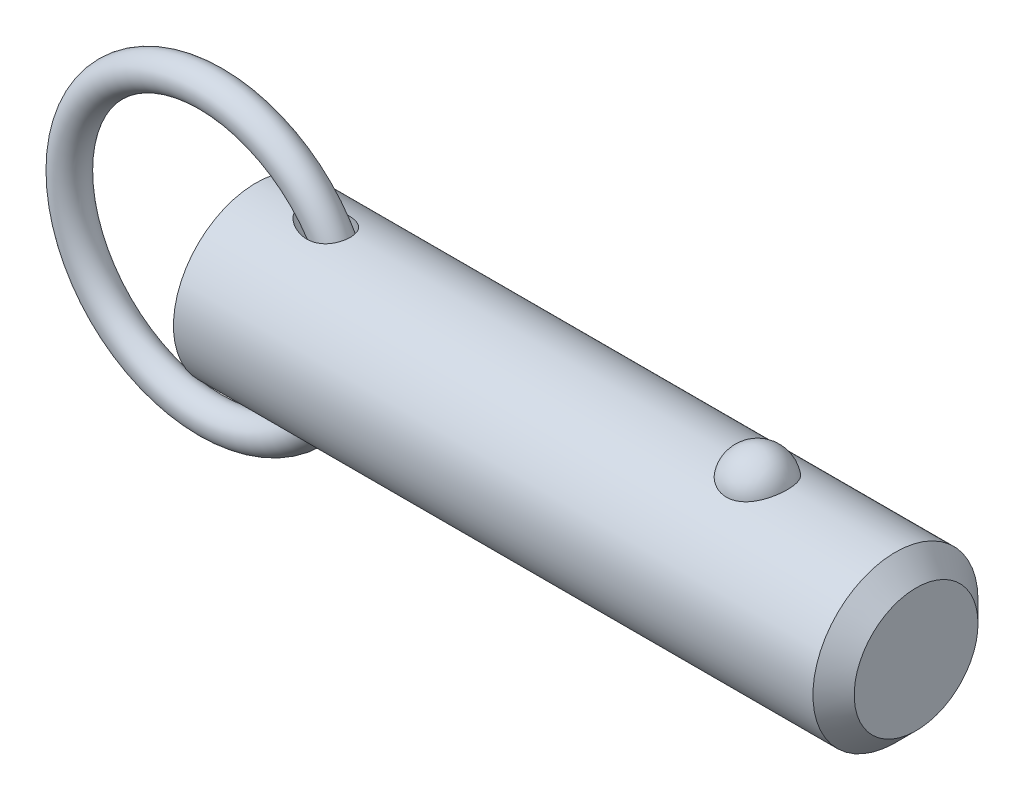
ISO-10303-21;
HEADER;
FILE_DESCRIPTION(('STEP AP214'),'2;1');
FILE_NAME('part.step','',(''),(''),'','','');
FILE_SCHEMA(('AUTOMOTIVE_DESIGN { 1 0 10303 214 1 1 1 1 }'));
ENDSEC;
DATA;
#1=APPLICATION_CONTEXT('core data for automotive mechanical design processes');
#2=APPLICATION_PROTOCOL_DEFINITION('international standard','automotive_design',2000,#1);
#3=PRODUCT_CONTEXT('',#1,'mechanical');
#4=PRODUCT('Part','Part','',(#3));
#5=PRODUCT_RELATED_PRODUCT_CATEGORY('part','',(#4));
#6=PRODUCT_DEFINITION_FORMATION('','',#4);
#7=PRODUCT_DEFINITION_CONTEXT('part definition',#1,'design');
#8=PRODUCT_DEFINITION('design','',#6,#7);
#9=PRODUCT_DEFINITION_SHAPE('','',#8);
#10=(LENGTH_UNIT() NAMED_UNIT(*) SI_UNIT(.MILLI.,.METRE.));
#11=(NAMED_UNIT(*) PLANE_ANGLE_UNIT() SI_UNIT($,.RADIAN.));
#12=(NAMED_UNIT(*) SI_UNIT($,.STERADIAN.) SOLID_ANGLE_UNIT());
#13=UNCERTAINTY_MEASURE_WITH_UNIT(LENGTH_MEASURE(1.E-05),#10,'distance_accuracy_value','');
#14=(GEOMETRIC_REPRESENTATION_CONTEXT(3) GLOBAL_UNCERTAINTY_ASSIGNED_CONTEXT((#13)) GLOBAL_UNIT_ASSIGNED_CONTEXT((#10,
#11,#12)) REPRESENTATION_CONTEXT('',''));
#15=CARTESIAN_POINT('',(0.,0.,0.));
#16=DIRECTION('',(0.,0.,1.));
#17=DIRECTION('',(1.,0.,0.));
#18=AXIS2_PLACEMENT_3D('',#15,#16,#17);
#19=CARTESIAN_POINT('',(-6.08699288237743,0.,0.));
#20=DIRECTION('',(0.,0.,1.));
#21=DIRECTION('',(1.,0.,0.));
#22=AXIS2_PLACEMENT_3D('',#19,#20,#21);
#23=TOROIDAL_SURFACE('',#22,19.05,2.223);
#24=CARTESIAN_POINT('',(15.1860071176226,0.,0.));
#25=VERTEX_POINT('',#24);
#26=VERTEX_LOOP('',#25);
#27=FACE_BOUND('',#26,.T.);
#28=ADVANCED_FACE('P0_F12',(#27),#23,.T.);
#29=CLOSED_SHELL('',(#28));
#30=MANIFOLD_SOLID_BREP('P0_B1',#29);
#31=CARTESIAN_POINT('',(0.,0.,0.));
#32=DIRECTION('',(1.,0.,0.));
#33=DIRECTION('',(0.,0.,-1.));
#34=AXIS2_PLACEMENT_3D('',#31,#32,#33);
#35=CYLINDRICAL_SURFACE('',#34,11.115);
#36=CARTESIAN_POINT('',(6.41405181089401,11.0227946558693,-1.4287136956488));
#37=CARTESIAN_POINT('',(6.49338916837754,11.0115377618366,-1.51556642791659));
#38=CARTESIAN_POINT('',(6.57765461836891,10.9998263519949,-1.59789397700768));
#39=CARTESIAN_POINT('',(6.75386647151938,10.9760304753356,-1.75391400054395));
#40=CARTESIAN_POINT('',(6.84582247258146,10.9639455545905,-1.82759540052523));
#41=CARTESIAN_POINT('',(7.03627827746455,10.9397989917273,-1.96698954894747));
#42=CARTESIAN_POINT('',(7.13480838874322,10.9277377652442,-2.03266078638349));
#43=CARTESIAN_POINT('',(7.33681032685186,10.9041015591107,-2.1558582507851));
#44=CARTESIAN_POINT('',(7.44028007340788,10.8925263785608,-2.21338786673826));
#45=CARTESIAN_POINT('',(7.64386117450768,10.8710104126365,-2.31666528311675));
#46=CARTESIAN_POINT('',(7.74368989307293,10.8610119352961,-2.36295942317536));
#47=CARTESIAN_POINT('',(7.94637195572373,10.8420168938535,-2.44863486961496));
#48=CARTESIAN_POINT('',(8.04922612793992,10.8330206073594,-2.48801426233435));
#49=CARTESIAN_POINT('',(8.36115573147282,10.807980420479,-2.59542730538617));
#50=CARTESIAN_POINT('',(8.57411849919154,10.7938278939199,-2.65299817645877));
#51=CARTESIAN_POINT('',(9.00825016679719,10.7725818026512,-2.73800108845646));
#52=CARTESIAN_POINT('',(9.22947335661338,10.7655491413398,-2.76517330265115));
#53=CARTESIAN_POINT('',(9.67368141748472,10.7605872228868,-2.78445308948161));
#54=CARTESIAN_POINT('',(9.89666486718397,10.7626512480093,-2.77658653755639));
#55=CARTESIAN_POINT('',(10.2950172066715,10.7754452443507,-2.72644436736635));
#56=CARTESIAN_POINT('',(10.4712789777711,10.7844280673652,-2.69109376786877));
#57=CARTESIAN_POINT('',(10.7292776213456,10.8024982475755,-2.61722365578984));
#58=CARTESIAN_POINT('',(10.8142337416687,10.8092901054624,-2.58911576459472));
#59=CARTESIAN_POINT('',(10.9813218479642,10.8242580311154,-2.52581287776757));
#60=CARTESIAN_POINT('',(11.0634550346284,10.8324335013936,-2.49062094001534));
#61=CARTESIAN_POINT('',(11.2247418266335,10.8500287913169,-2.41281958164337));
#62=CARTESIAN_POINT('',(11.3038694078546,10.8594572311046,-2.37015806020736));
#63=CARTESIAN_POINT('',(11.4576781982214,10.8792243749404,-2.27770403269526));
#64=CARTESIAN_POINT('',(11.5323615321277,10.8895626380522,-2.22791497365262));
#65=CARTESIAN_POINT('',(11.6765388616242,10.9108113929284,-2.12140590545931));
#66=CARTESIAN_POINT('',(11.7460329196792,10.9217218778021,-2.064685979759));
#67=CARTESIAN_POINT('',(11.8790597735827,10.9437207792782,-1.94471764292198));
#68=CARTESIAN_POINT('',(11.9425932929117,10.9548091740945,-1.88147002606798));
#69=CARTESIAN_POINT('',(12.109388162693,10.9851999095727,-1.69784918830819));
#70=CARTESIAN_POINT('',(12.205655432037,11.0042655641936,-1.57093023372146));
#71=CARTESIAN_POINT('',(12.374151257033,11.0393391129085,-1.3017676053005));
#72=CARTESIAN_POINT('',(12.4463875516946,11.0553479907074,-1.15952888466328));
#73=CARTESIAN_POINT('',(12.5615818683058,11.0816338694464,-0.871972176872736));
#74=CARTESIAN_POINT('',(12.6058896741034,11.0921698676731,-0.727217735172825));
#75=CARTESIAN_POINT('',(12.6699315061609,11.1075802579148,-0.432089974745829));
#76=CARTESIAN_POINT('',(12.6896681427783,11.1124552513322,-0.281717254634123));
#77=CARTESIAN_POINT('',(12.7040225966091,11.1159901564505,0.0188164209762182));
#78=CARTESIAN_POINT('',(12.6988836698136,11.1147102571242,0.16896512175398));
#79=CARTESIAN_POINT('',(12.6641681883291,11.1062126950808,0.46623811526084));
#80=CARTESIAN_POINT('',(12.6345920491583,11.0989951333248,0.613362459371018));
#81=CARTESIAN_POINT('',(12.5517453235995,11.0794095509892,0.900330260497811));
#82=CARTESIAN_POINT('',(12.4984878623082,11.0670443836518,1.04017770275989));
#83=CARTESIAN_POINT('',(12.3696588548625,11.0385082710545,1.308745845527));
#84=CARTESIAN_POINT('',(12.2940887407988,11.0223375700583,1.43746725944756));
#85=CARTESIAN_POINT('',(12.122380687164,10.987872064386,1.68079704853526));
#86=CARTESIAN_POINT('',(12.0261637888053,10.969569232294,1.79534850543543));
#87=CARTESIAN_POINT('',(11.8161707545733,10.932836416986,2.00695695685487));
#88=CARTESIAN_POINT('',(11.7023941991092,10.9144064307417,2.10401353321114));
#89=CARTESIAN_POINT('',(11.4575656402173,10.8788057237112,2.28105326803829));
#90=CARTESIAN_POINT('',(11.3261451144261,10.8616794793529,2.36053412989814));
#91=CARTESIAN_POINT('',(11.0523589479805,10.8308019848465,2.49839044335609));
#92=CARTESIAN_POINT('',(10.9099908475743,10.8170514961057,2.55676113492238));
#93=CARTESIAN_POINT('',(10.6060622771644,10.7929728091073,2.65666105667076));
#94=CARTESIAN_POINT('',(10.4438877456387,10.7830209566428,2.69640163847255));
#95=CARTESIAN_POINT('',(10.1154037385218,10.7687230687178,2.75293129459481));
#96=CARTESIAN_POINT('',(9.94909141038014,10.7643810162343,2.76970406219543));
#97=CARTESIAN_POINT('',(9.54387061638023,10.7604809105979,2.7848723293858));
#98=CARTESIAN_POINT('',(9.30446860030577,10.7637793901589,2.7722775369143));
#99=CARTESIAN_POINT('',(8.9496125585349,10.7757341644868,2.72524141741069));
#100=CARTESIAN_POINT('',(8.83186896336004,10.7808994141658,2.70482239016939));
#101=CARTESIAN_POINT('',(8.59835142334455,10.7932548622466,2.6550999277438));
#102=CARTESIAN_POINT('',(8.48257728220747,10.8004448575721,2.62579738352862));
#103=CARTESIAN_POINT('',(8.25208469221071,10.8166382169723,2.55827624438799));
#104=CARTESIAN_POINT('',(8.13740214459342,10.8256649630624,2.51994155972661));
#105=CARTESIAN_POINT('',(7.91132058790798,10.8451170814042,2.43486475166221));
#106=CARTESIAN_POINT('',(7.79992154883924,10.8555424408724,2.38812270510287));
#107=CARTESIAN_POINT('',(7.58115677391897,10.8774251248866,2.28638483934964));
#108=CARTESIAN_POINT('',(7.47378802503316,10.8888816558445,2.23139534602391));
#109=CARTESIAN_POINT('',(7.26385624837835,10.9124540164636,2.1131026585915));
#110=CARTESIAN_POINT('',(7.1612916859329,10.9245696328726,2.04980214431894));
#111=CARTESIAN_POINT('',(6.91882218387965,10.9543689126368,1.88540538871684));
#112=CARTESIAN_POINT('',(6.78193778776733,10.9721958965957,1.77979827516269));
#113=CARTESIAN_POINT('',(6.5247244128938,11.0070222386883,1.54989693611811));
#114=CARTESIAN_POINT('',(6.40436902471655,11.0240228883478,1.42563320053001));
#115=CARTESIAN_POINT('',(6.21838804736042,11.0509658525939,1.19529359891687));
#116=CARTESIAN_POINT('',(6.14691885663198,11.0615430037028,1.09404520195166));
#117=CARTESIAN_POINT('',(6.02043496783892,11.0805004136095,0.881508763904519));
#118=CARTESIAN_POINT('',(5.96539400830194,11.0888841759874,0.770237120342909));
#119=CARTESIAN_POINT('',(5.88475453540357,11.1012553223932,0.560577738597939));
#120=CARTESIAN_POINT('',(5.85559643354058,11.1057686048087,0.463603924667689));
#121=CARTESIAN_POINT('',(5.81381299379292,11.1122523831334,0.266083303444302));
#122=CARTESIAN_POINT('',(5.80117118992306,11.1142254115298,0.16554015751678));
#123=CARTESIAN_POINT('',(5.79363815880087,11.1153999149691,-0.0364747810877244));
#124=CARTESIAN_POINT('',(5.79878799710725,11.1145949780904,-0.137948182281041));
#125=CARTESIAN_POINT('',(5.82639592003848,11.1102987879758,-0.338493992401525));
#126=CARTESIAN_POINT('',(5.84887234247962,11.1068046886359,-0.437563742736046));
#127=CARTESIAN_POINT('',(5.91510741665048,11.0965857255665,-0.649968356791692));
#128=CARTESIAN_POINT('',(5.9622090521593,11.0893566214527,-0.762222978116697));
#129=CARTESIAN_POINT('',(6.07378449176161,11.072471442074,-0.97739679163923));
#130=CARTESIAN_POINT('',(6.13826787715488,11.0628140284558,-1.08031079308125));
#131=CARTESIAN_POINT('',(6.2410107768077,11.0477136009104,-1.22195806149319));
#132=CARTESIAN_POINT('',(6.27403486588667,11.042895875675,-1.26469183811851));
#133=CARTESIAN_POINT('',(6.34238022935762,11.0330152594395,-1.34817011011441));
#134=CARTESIAN_POINT('',(6.37769867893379,11.0279526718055,-1.38891694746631));
#135=CARTESIAN_POINT('',(6.41405181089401,11.0227946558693,-1.4287136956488));
#136=B_SPLINE_CURVE_WITH_KNOTS('',3,(#36,#37,#38,#39,#40,#41,#42,#43,#44,#45,#46,#47,#48,#49,
#50,#51,#52,#53,#54,#55,#56,#57,#58,#59,#60,#61,#62,#63,#64,#65,#66,#67,#68,#69,#70,#71,#72,#73,
#74,#75,#76,#77,#78,#79,#80,#81,#82,#83,#84,#85,#86,#87,#88,#89,#90,#91,#92,#93,#94,#95,#96,#97,
#98,#99,#100,#101,#102,#103,#104,#105,#106,#107,#108,#109,#110,#111,#112,#113,#114,#115,#116,
#117,#118,#119,#120,#121,#122,#123,#124,#125,#126,#127,#128,#129,#130,#131,#132,#133,#134,#135),
.UNSPECIFIED.,.T.,.F.,(4,2,2,2,2,2,2,2,2,2,2,2,2,2,2,2,2,2,2,2,2,2,2,2,2,2,2,2,2,2,2,2,2,2,2,2,
2,2,2,2,2,2,2,2,2,2,2,2,2,4),(0.,0.35443329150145,0.709315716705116,1.0659654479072,
1.42246628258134,1.7536715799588,2.08496839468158,2.74582009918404,3.41227815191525,
4.07824412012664,4.61583787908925,4.88478112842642,5.1536085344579,5.42439170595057,
5.69504436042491,5.96569375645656,6.23631025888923,6.71490729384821,7.1933500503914,
7.64641437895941,8.09943057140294,8.54802575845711,8.99661331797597,9.44495256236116,
9.89326303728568,10.3433195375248,10.7933867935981,11.2550086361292,11.7167345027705,
12.2165866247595,12.7167934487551,13.4318876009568,13.7904664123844,14.1490092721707,
14.5124394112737,14.8758662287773,15.239015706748,15.6020483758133,16.1219860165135,
16.6410830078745,17.0130520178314,17.3844231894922,17.6872330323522,17.9897407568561,
18.2929471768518,18.5964749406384,18.9603532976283,19.3244326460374,19.4870338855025,
19.649438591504),.UNSPECIFIED.);
#137=CARTESIAN_POINT('',(6.41405181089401,11.0227946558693,-1.4287136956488));
#138=VERTEX_POINT('',#137);
#139=EDGE_CURVE('P1_E40',#138,#138,#136,.T.);
#140=ORIENTED_EDGE('',*,*,#139,.T.);
#141=EDGE_LOOP('',(#140));
#142=FACE_BOUND('',#141,.T.);
#143=CARTESIAN_POINT('',(86.12125,0.,0.));
#144=DIRECTION('',(1.,0.,0.));
#145=DIRECTION('',(0.,0.,-1.));
#146=AXIS2_PLACEMENT_3D('',#143,#144,#145);
#147=CIRCLE('',#146,11.115);
#148=CARTESIAN_POINT('',(86.12125,0.,-11.115));
#149=VERTEX_POINT('',#148);
#150=EDGE_CURVE('P1_E25',#149,#149,#147,.T.);
#151=ORIENTED_EDGE('',*,*,#150,.F.);
#152=EDGE_LOOP('',(#151));
#153=FACE_BOUND('',#152,.T.);
#154=CARTESIAN_POINT('',(0.,0.,0.));
#155=DIRECTION('',(1.,0.,0.));
#156=DIRECTION('',(0.,0.,-1.));
#157=AXIS2_PLACEMENT_3D('',#154,#155,#156);
#158=CIRCLE('',#157,11.115);
#159=CARTESIAN_POINT('',(0.,0.,-11.115));
#160=VERTEX_POINT('',#159);
#161=EDGE_CURVE('P1_E9',#160,#160,#158,.T.);
#162=ORIENTED_EDGE('',*,*,#161,.T.);
#163=EDGE_LOOP('',(#162));
#164=FACE_BOUND('',#163,.T.);
#165=CARTESIAN_POINT('',(67.5310680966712,10.3028087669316,4.17077409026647));
#166=CARTESIAN_POINT('',(67.3147756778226,10.3028003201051,4.17078240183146));
#167=CARTESIAN_POINT('',(67.0985488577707,10.3098895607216,4.15340593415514));
#168=CARTESIAN_POINT('',(66.6725408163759,10.3373834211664,4.08449540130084));
#169=CARTESIAN_POINT('',(66.4627577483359,10.3577841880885,4.03297121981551));
#170=CARTESIAN_POINT('',(66.0557825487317,10.4095237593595,3.89746513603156));
#171=CARTESIAN_POINT('',(65.8585726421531,10.4408466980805,3.81353029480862));
#172=CARTESIAN_POINT('',(65.4813382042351,10.5110236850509,3.61560339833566));
#173=CARTESIAN_POINT('',(65.3013171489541,10.5498792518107,3.50160528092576));
#174=CARTESIAN_POINT('',(64.9576842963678,10.6322884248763,3.24292464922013));
#175=CARTESIAN_POINT('',(64.7946861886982,10.6759443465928,3.09746040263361));
#176=CARTESIAN_POINT('',(64.4945911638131,10.7625291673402,2.78171925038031));
#177=CARTESIAN_POINT('',(64.3574990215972,10.8054579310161,2.61143778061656));
#178=CARTESIAN_POINT('',(64.1064084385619,10.8881935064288,2.24226695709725));
#179=CARTESIAN_POINT('',(63.9937105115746,10.9277761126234,2.04244123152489));
#180=CARTESIAN_POINT('',(63.8017771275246,10.997484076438,1.62578254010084));
#181=CARTESIAN_POINT('',(63.722544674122,11.0276085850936,1.40894804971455));
#182=CARTESIAN_POINT('',(63.5983034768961,11.0756732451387,0.961250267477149));
#183=CARTESIAN_POINT('',(63.553760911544,11.0934470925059,0.730239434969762));
#184=CARTESIAN_POINT('',(63.5015695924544,11.1143331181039,0.263439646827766));
#185=CARTESIAN_POINT('',(63.4939200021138,11.1174456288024,0.0276507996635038));
#186=CARTESIAN_POINT('',(63.5156105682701,11.1087161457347,-0.440729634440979));
#187=CARTESIAN_POINT('',(63.5447624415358,11.0969502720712,-0.673331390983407));
#188=CARTESIAN_POINT('',(63.6391432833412,11.0597872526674,-1.12996621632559));
#189=CARTESIAN_POINT('',(63.7043729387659,11.0343898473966,-1.35399912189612));
#190=CARTESIAN_POINT('',(63.8696984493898,10.972515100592,-1.78750286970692));
#191=CARTESIAN_POINT('',(63.9698386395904,10.9360236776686,-1.99695478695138));
#192=CARTESIAN_POINT('',(64.2029408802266,10.8557595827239,-2.39520667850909));
#193=CARTESIAN_POINT('',(64.3359054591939,10.8119863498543,-2.5840050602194));
#194=CARTESIAN_POINT('',(64.632407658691,10.7216733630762,-2.93635726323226));
#195=CARTESIAN_POINT('',(64.7960565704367,10.675123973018,-3.09981510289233));
#196=CARTESIAN_POINT('',(65.1498601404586,10.5846571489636,-3.39592247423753));
#197=CARTESIAN_POINT('',(65.3400123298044,10.5407394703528,-3.52857487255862));
#198=CARTESIAN_POINT('',(65.7375014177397,10.4616690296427,-3.75646057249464));
#199=CARTESIAN_POINT('',(65.9443670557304,10.4263443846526,-3.85245432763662));
#200=CARTESIAN_POINT('',(66.3729541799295,10.3675574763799,-4.0079874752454));
#201=CARTESIAN_POINT('',(66.594670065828,10.3440907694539,-4.06754052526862));
#202=CARTESIAN_POINT('',(67.0346695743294,10.3128282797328,-4.14614314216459));
#203=CARTESIAN_POINT('',(67.2525654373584,10.3043040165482,-4.16707833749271));
#204=CARTESIAN_POINT('',(67.68894951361,10.3016771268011,-4.17357158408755));
#205=CARTESIAN_POINT('',(67.9074376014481,10.3075716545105,-4.15913661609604));
#206=CARTESIAN_POINT('',(68.3317442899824,10.3326686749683,-4.09636961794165));
#207=CARTESIAN_POINT('',(68.5377458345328,10.3514555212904,-4.04909574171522));
#208=CARTESIAN_POINT('',(68.9385764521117,10.3998183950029,-3.92320197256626));
#209=CARTESIAN_POINT('',(69.1334046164,10.4293952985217,-3.84457953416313));
#210=CARTESIAN_POINT('',(69.5111917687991,10.4969600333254,-3.65612410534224));
#211=CARTESIAN_POINT('',(69.6937974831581,10.5351178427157,-3.5456454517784));
#212=CARTESIAN_POINT('',(70.0382040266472,10.6154999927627,-3.29718036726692));
#213=CARTESIAN_POINT('',(70.200000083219,10.657725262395,-3.15918764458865));
#214=CARTESIAN_POINT('',(70.5069596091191,10.744212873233,-2.85163580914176));
#215=CARTESIAN_POINT('',(70.6508919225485,10.7884718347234,-2.68084605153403));
#216=CARTESIAN_POINT('',(70.9092371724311,10.872374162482,-2.31721864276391));
#217=CARTESIAN_POINT('',(71.0236448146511,10.9120167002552,-2.12437704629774));
#218=CARTESIAN_POINT('',(71.2238739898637,10.9838919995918,-1.71516999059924));
#219=CARTESIAN_POINT('',(71.3086617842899,11.0158465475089,-1.49824866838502));
#220=CARTESIAN_POINT('',(71.4426838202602,11.0673523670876,-1.05228572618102));
#221=CARTESIAN_POINT('',(71.4919174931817,11.086903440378,-0.823243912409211));
#222=CARTESIAN_POINT('',(71.5538915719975,11.1116323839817,-0.359087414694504));
#223=CARTESIAN_POINT('',(71.5665662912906,11.1167843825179,-0.123962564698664));
#224=CARTESIAN_POINT('',(71.554973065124,11.1121144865,0.345220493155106));
#225=CARTESIAN_POINT('',(71.5307056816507,11.1022928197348,0.579278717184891));
#226=CARTESIAN_POINT('',(71.4459073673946,11.0687504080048,1.03866534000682));
#227=CARTESIAN_POINT('',(71.3855299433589,11.0450885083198,1.26402641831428));
#228=CARTESIAN_POINT('',(71.2298532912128,10.9863185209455,1.70076772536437));
#229=CARTESIAN_POINT('',(71.134551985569,10.9512097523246,1.91214712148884));
#230=CARTESIAN_POINT('',(70.9103974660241,10.8729733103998,2.316083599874));
#231=CARTESIAN_POINT('',(70.7813806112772,10.8298068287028,2.50854240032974));
#232=CARTESIAN_POINT('',(70.4927327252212,10.7401896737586,2.86808766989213));
#233=CARTESIAN_POINT('',(70.3331022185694,10.6937390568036,3.03517457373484));
#234=CARTESIAN_POINT('',(69.9875341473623,10.6029321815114,3.33857581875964));
#235=CARTESIAN_POINT('',(69.8017089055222,10.5585680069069,3.47501541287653));
#236=CARTESIAN_POINT('',(69.4078750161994,10.4769321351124,3.71390897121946));
#237=CARTESIAN_POINT('',(69.1998635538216,10.439661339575,3.81635861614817));
#238=CARTESIAN_POINT('',(68.7540666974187,10.3749407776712,3.98910631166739));
#239=CARTESIAN_POINT('',(68.5152342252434,10.3482457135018,4.05700929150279));
#240=CARTESIAN_POINT('',(68.0279254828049,10.312188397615,4.14782844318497));
#241=CARTESIAN_POINT('',(67.7794535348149,10.3028184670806,4.17076454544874));
#242=CARTESIAN_POINT('',(67.5310680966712,10.3028087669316,4.17077409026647));
#243=B_SPLINE_CURVE_WITH_KNOTS('',3,(#165,#166,#167,#168,#169,#170,#171,#172,#173,#174,#175,
#176,#177,#178,#179,#180,#181,#182,#183,#184,#185,#186,#187,#188,#189,#190,#191,#192,#193,#194,
#195,#196,#197,#198,#199,#200,#201,#202,#203,#204,#205,#206,#207,#208,#209,#210,#211,#212,#213,
#214,#215,#216,#217,#218,#219,#220,#221,#222,#223,#224,#225,#226,#227,#228,#229,#230,#231,#232,
#233,#234,#235,#236,#237,#238,#239,#240,#241,#242),.UNSPECIFIED.,.T.,.F.,(4,2,2,2,2,2,2,2,2,2,2,
2,2,2,2,2,2,2,2,2,2,2,2,2,2,2,2,2,2,2,2,2,2,2,2,2,2,2,4),(0.,0.647966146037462,1.29574482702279,
1.94258643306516,2.58955857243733,3.25496465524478,3.92049326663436,4.61566368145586,
5.31089647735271,6.0153182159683,6.71972398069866,7.42054043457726,8.12137023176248,
8.82309331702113,9.52487047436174,10.2292439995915,10.9335519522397,11.622333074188,
12.3108558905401,12.9647664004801,13.6185478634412,14.2521847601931,14.8858731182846,
15.5334360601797,16.1811472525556,16.8611459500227,17.5412664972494,18.2431855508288,
18.9451158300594,19.6483065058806,20.3514864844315,21.0516982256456,21.7519516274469,
22.4556690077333,23.1593743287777,23.8601491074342,24.5610129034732,25.3054529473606,
26.0495629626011),.UNSPECIFIED.);
#244=CARTESIAN_POINT('',(67.5310680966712,10.3028087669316,4.17077409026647));
#245=VERTEX_POINT('',#244);
#246=EDGE_CURVE('P1_E34',#245,#245,#243,.T.);
#247=ORIENTED_EDGE('',*,*,#246,.T.);
#248=EDGE_LOOP('',(#247));
#249=FACE_BOUND('',#248,.T.);
#250=CARTESIAN_POINT('',(6.41405181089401,-11.0227946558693,-1.4287136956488));
#251=CARTESIAN_POINT('',(6.33124061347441,-11.0345445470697,-1.33806125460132));
#252=CARTESIAN_POINT('',(6.25372866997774,-11.0458090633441,-1.24240732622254));
#253=CARTESIAN_POINT('',(6.11277905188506,-11.0666115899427,-1.04095704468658));
#254=CARTESIAN_POINT('',(6.0493392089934,-11.0761498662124,-0.935162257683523));
#255=CARTESIAN_POINT('',(5.94029181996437,-11.0927063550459,-0.71247649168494));
#256=CARTESIAN_POINT('',(5.89492964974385,-11.0996897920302,-0.595457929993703));
#257=CARTESIAN_POINT('',(5.8449816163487,-11.1074141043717,-0.414997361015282));
#258=CARTESIAN_POINT('',(5.83135004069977,-11.1095300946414,-0.354047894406));
#259=CARTESIAN_POINT('',(5.81051649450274,-11.1127688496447,-0.231041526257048));
#260=CARTESIAN_POINT('',(5.80331311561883,-11.1138918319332,-0.168984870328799));
#261=CARTESIAN_POINT('',(5.79296529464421,-11.1155042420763,-0.000484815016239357));
#262=CARTESIAN_POINT('',(5.79625267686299,-11.1149904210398,0.106437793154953));
#263=CARTESIAN_POINT('',(5.82213676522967,-11.1109609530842,0.317809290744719));
#264=CARTESIAN_POINT('',(5.84474662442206,-11.1074432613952,0.422256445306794));
#265=CARTESIAN_POINT('',(5.91113114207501,-11.097197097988,0.63936180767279));
#266=CARTESIAN_POINT('',(5.95733120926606,-11.090102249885,0.75125097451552));
#267=CARTESIAN_POINT('',(6.06709542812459,-11.0734770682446,0.965912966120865));
#268=CARTESIAN_POINT('',(6.13068735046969,-11.06394284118,1.06867085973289));
#269=CARTESIAN_POINT('',(6.30294237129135,-11.0385920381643,1.30890635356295));
#270=CARTESIAN_POINT('',(6.4189620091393,-11.0218881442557,1.44097376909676));
#271=CARTESIAN_POINT('',(6.66989654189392,-10.9871512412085,1.68553954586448));
#272=CARTESIAN_POINT('',(6.80485520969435,-10.9691152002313,1.79799117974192));
#273=CARTESIAN_POINT('',(7.04881236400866,-10.9382283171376,1.97587596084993));
#274=CARTESIAN_POINT('',(7.15465712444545,-10.9253240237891,2.04570822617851));
#275=CARTESIAN_POINT('',(7.37202504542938,-10.9000987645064,2.17611840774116));
#276=CARTESIAN_POINT('',(7.48355057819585,-10.8877780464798,2.23669241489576));
#277=CARTESIAN_POINT('',(7.71132418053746,-10.8641580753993,2.34873831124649));
#278=CARTESIAN_POINT('',(7.82757727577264,-10.8528599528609,2.40020018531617));
#279=CARTESIAN_POINT('',(8.06386825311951,-10.8317234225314,2.49385169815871));
#280=CARTESIAN_POINT('',(8.18390558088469,-10.8218848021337,2.53604268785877));
#281=CARTESIAN_POINT('',(8.42918336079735,-10.8039208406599,2.61152283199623));
#282=CARTESIAN_POINT('',(8.55447802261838,-10.7958283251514,2.64464414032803));
#283=CARTESIAN_POINT('',(8.80752127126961,-10.781995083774,2.70048793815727));
#284=CARTESIAN_POINT('',(8.93527019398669,-10.7762546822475,2.72320899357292));
#285=CARTESIAN_POINT('',(9.19210176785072,-10.7675291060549,2.75750994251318));
#286=CARTESIAN_POINT('',(9.32118105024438,-10.7645381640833,2.76911315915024));
#287=CARTESIAN_POINT('',(9.57984338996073,-10.761622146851,2.78042035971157));
#288=CARTESIAN_POINT('',(9.70942621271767,-10.7616957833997,2.78012934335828));
#289=CARTESIAN_POINT('',(10.0243125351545,-10.7659059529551,2.76381534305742));
#290=CARTESIAN_POINT('',(10.209307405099,-10.7717977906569,2.74099674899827));
#291=CARTESIAN_POINT('',(10.5731188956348,-10.7905408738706,2.66626238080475));
#292=CARTESIAN_POINT('',(10.7519389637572,-10.8033881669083,2.61436313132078));
#293=CARTESIAN_POINT('',(11.0114289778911,-10.8271584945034,2.51336808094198));
#294=CARTESIAN_POINT('',(11.096831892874,-10.835881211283,2.47562331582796));
#295=CARTESIAN_POINT('',(11.2636000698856,-10.8545688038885,2.39236170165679));
#296=CARTESIAN_POINT('',(11.3449673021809,-10.8645330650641,2.3468486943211));
#297=CARTESIAN_POINT('',(11.5027832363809,-10.8853818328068,2.24815967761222));
#298=CARTESIAN_POINT('',(11.5792327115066,-10.8962661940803,2.19498487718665));
#299=CARTESIAN_POINT('',(11.7263315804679,-10.9185541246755,2.08128855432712));
#300=CARTESIAN_POINT('',(11.7969818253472,-10.9299576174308,2.02076811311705));
#301=CARTESIAN_POINT('',(11.9817953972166,-10.9613645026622,1.84513663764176));
#302=CARTESIAN_POINT('',(12.0893012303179,-10.9814643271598,1.72286660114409));
#303=CARTESIAN_POINT('',(12.2803576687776,-11.0193991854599,1.46066991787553));
#304=CARTESIAN_POINT('',(12.3639173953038,-11.0372350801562,1.3207500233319));
#305=CARTESIAN_POINT('',(12.4996220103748,-11.0672969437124,1.03778067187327));
#306=CARTESIAN_POINT('',(12.5535315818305,-11.0798242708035,0.895607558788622));
#307=CARTESIAN_POINT('',(12.636874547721,-11.0995427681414,0.603918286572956));
#308=CARTESIAN_POINT('',(12.6663115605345,-11.1067347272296,0.454403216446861));
#309=CARTESIAN_POINT('',(12.6997387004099,-11.1149224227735,0.154577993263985));
#310=CARTESIAN_POINT('',(12.7040886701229,-11.1160057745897,0.00431019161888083));
#311=CARTESIAN_POINT('',(12.6882048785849,-11.1120956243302,-0.294841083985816));
#312=CARTESIAN_POINT('',(12.6679715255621,-11.1071022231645,-0.443724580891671));
#313=CARTESIAN_POINT('',(12.6034470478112,-11.0915888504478,-0.735688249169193));
#314=CARTESIAN_POINT('',(12.5591858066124,-11.0810757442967,-0.878775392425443));
#315=CARTESIAN_POINT('',(12.4477416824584,-11.0556687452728,-1.15529525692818));
#316=CARTESIAN_POINT('',(12.3805601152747,-11.0407751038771,-1.28872853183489));
#317=CARTESIAN_POINT('',(12.2248919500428,-11.0081839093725,-1.54257976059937));
#318=CARTESIAN_POINT('',(12.1363549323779,-10.9904797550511,-1.66296592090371));
#319=CARTESIAN_POINT('',(11.9406137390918,-10.9541951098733,-1.88726577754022));
#320=CARTESIAN_POINT('',(11.833409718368,-10.9356146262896,-1.9911796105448));
#321=CARTESIAN_POINT('',(11.601318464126,-10.8991360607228,-2.18213646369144));
#322=CARTESIAN_POINT('',(11.4761325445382,-10.8812577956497,-2.26881927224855));
#323=CARTESIAN_POINT('',(11.2134852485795,-10.8482871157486,-2.42157282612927));
#324=CARTESIAN_POINT('',(11.0760218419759,-10.8331951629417,-2.48764015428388));
#325=CARTESIAN_POINT('',(10.7828968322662,-10.8061050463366,-2.60290068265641));
#326=CARTESIAN_POINT('',(10.6266338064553,-10.7943907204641,-2.65062248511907));
#327=CARTESIAN_POINT('',(10.3086617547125,-10.7762429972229,-2.72345054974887));
#328=CARTESIAN_POINT('',(10.146948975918,-10.7698133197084,-2.74854088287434));
#329=CARTESIAN_POINT('',(9.75541304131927,-10.7608036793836,-2.78368719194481));
#330=CARTESIAN_POINT('',(9.52459435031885,-10.7608467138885,-2.78350276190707));
#331=CARTESIAN_POINT('',(9.06604960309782,-10.7702674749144,-2.74677945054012));
#332=CARTESIAN_POINT('',(8.83832966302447,-10.7796615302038,-2.71017697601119));
#333=CARTESIAN_POINT('',(8.38783466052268,-10.8058248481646,-2.60392490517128));
#334=CARTESIAN_POINT('',(8.16517101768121,-10.8226939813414,-2.53382676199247));
#335=CARTESIAN_POINT('',(7.84087311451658,-10.8516548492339,-2.40555545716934));
#336=CARTESIAN_POINT('',(7.73435551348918,-10.8619221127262,-2.35892455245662));
#337=CARTESIAN_POINT('',(7.52510420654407,-10.883357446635,-2.25797017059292));
#338=CARTESIAN_POINT('',(7.42236986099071,-10.8945253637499,-2.20364800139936));
#339=CARTESIAN_POINT('',(7.23808758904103,-10.915528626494,-2.09688018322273));
#340=CARTESIAN_POINT('',(7.15584631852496,-10.9252787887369,-2.0456107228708));
#341=CARTESIAN_POINT('',(6.99510576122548,-10.944960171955,-1.93754729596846));
#342=CARTESIAN_POINT('',(6.91660574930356,-10.9548913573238,-1.88075440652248));
#343=CARTESIAN_POINT('',(6.76418133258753,-10.974690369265,-1.76154504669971));
#344=CARTESIAN_POINT('',(6.69024940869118,-10.9845582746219,-1.6991382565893));
#345=CARTESIAN_POINT('',(6.54780119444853,-11.0039826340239,-1.56842485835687));
#346=CARTESIAN_POINT('',(6.47928247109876,-11.0135392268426,-1.50012092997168));
#347=CARTESIAN_POINT('',(6.41405181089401,-11.0227946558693,-1.4287136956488));
#348=B_SPLINE_CURVE_WITH_KNOTS('',3,(#250,#251,#252,#253,#254,#255,#256,#257,#258,#259,#260,
#261,#262,#263,#264,#265,#266,#267,#268,#269,#270,#271,#272,#273,#274,#275,#276,#277,#278,#279,
#280,#281,#282,#283,#284,#285,#286,#287,#288,#289,#290,#291,#292,#293,#294,#295,#296,#297,#298,
#299,#300,#301,#302,#303,#304,#305,#306,#307,#308,#309,#310,#311,#312,#313,#314,#315,#316,#317,
#318,#319,#320,#321,#322,#323,#324,#325,#326,#327,#328,#329,#330,#331,#332,#333,#334,#335,#336,
#337,#338,#339,#340,#341,#342,#343,#344,#345,#346,#347),.UNSPECIFIED.,.T.,.F.,(4,2,2,2,2,2,2,2,
2,2,2,2,2,2,2,2,2,2,2,2,2,2,2,2,2,2,2,2,2,2,2,2,2,2,2,2,2,2,2,2,2,2,2,2,2,2,2,2,4),(0.,
0.36983565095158,0.739614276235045,1.1142538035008,1.30141910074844,1.48854338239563,
1.8074587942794,2.12659146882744,2.4883888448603,2.85076733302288,3.3776216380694,
3.90571433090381,4.287639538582,4.66972556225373,5.05222896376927,5.43467659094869,
5.82378546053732,6.21294796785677,6.60129228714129,6.9894733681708,7.54669558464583,
8.10360148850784,8.38458539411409,8.66543074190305,8.94623182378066,9.22699162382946,
9.7162888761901,10.2053995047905,10.6608871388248,11.1163074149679,11.5651786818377,
12.0140424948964,12.4623493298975,12.9106304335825,13.3599804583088,13.8093267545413,
14.2672570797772,14.7252632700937,15.214740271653,15.7045615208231,16.3932594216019,
17.083162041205,17.7825738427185,18.1325177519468,18.4824022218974,18.7744056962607,
19.0663523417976,19.3578048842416,19.6491256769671),.UNSPECIFIED.);
#349=CARTESIAN_POINT('',(6.41405181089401,-11.0227946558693,-1.4287136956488));
#350=VERTEX_POINT('',#349);
#351=EDGE_CURVE('P1_E17',#350,#350,#348,.T.);
#352=ORIENTED_EDGE('',*,*,#351,.T.);
#353=EDGE_LOOP('',(#352));
#354=FACE_BOUND('',#353,.T.);
#355=ADVANCED_FACE('P1_F13',(#142,#153,#164,#249,#354),#35,.T.);
#356=CARTESIAN_POINT('',(0.,0.,0.));
#357=DIRECTION('',(-1.,0.,0.));
#358=DIRECTION('',(0.,0.,1.));
#359=AXIS2_PLACEMENT_3D('',#356,#357,#358);
#360=PLANE('',#359);
#361=ORIENTED_EDGE('',*,*,#161,.F.);
#362=EDGE_LOOP('',(#361));
#363=FACE_BOUND('',#362,.T.);
#364=ADVANCED_FACE('P1_F15',(#363),#360,.T.);
#365=CARTESIAN_POINT('',(88.9,0.,0.));
#366=DIRECTION('',(-1.,0.,0.));
#367=DIRECTION('',(0.,0.,1.));
#368=AXIS2_PLACEMENT_3D('',#365,#366,#367);
#369=CONICAL_SURFACE('',#368,8.33625000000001,0.785398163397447);
#370=ORIENTED_EDGE('',*,*,#150,.T.);
#371=EDGE_LOOP('',(#370));
#372=FACE_BOUND('',#371,.T.);
#373=CARTESIAN_POINT('',(88.9,0.,0.));
#374=DIRECTION('',(1.,0.,0.));
#375=DIRECTION('',(0.,0.,-1.));
#376=AXIS2_PLACEMENT_3D('',#373,#374,#375);
#377=CIRCLE('',#376,8.33625000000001);
#378=CARTESIAN_POINT('',(88.9,0.,-8.33625000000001));
#379=VERTEX_POINT('',#378);
#380=EDGE_CURVE('P1_E30',#379,#379,#377,.T.);
#381=ORIENTED_EDGE('',*,*,#380,.F.);
#382=EDGE_LOOP('',(#381));
#383=FACE_BOUND('',#382,.T.);
#384=ADVANCED_FACE('P1_F55',(#372,#383),#369,.T.);
#385=CARTESIAN_POINT('',(88.9,8.33625000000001,0.));
#386=DIRECTION('',(1.,0.,0.));
#387=DIRECTION('',(0.,0.,-1.));
#388=AXIS2_PLACEMENT_3D('',#385,#386,#387);
#389=PLANE('',#388);
#390=ORIENTED_EDGE('',*,*,#380,.T.);
#391=EDGE_LOOP('',(#390));
#392=FACE_BOUND('',#391,.T.);
#393=ADVANCED_FACE('P1_F51',(#392),#389,.T.);
#394=CARTESIAN_POINT('',(67.5310680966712,10.0035,0.));
#395=DIRECTION('',(-1.,0.,0.));
#396=DIRECTION('',(0.,1.,0.));
#397=AXIS2_PLACEMENT_3D('',#394,#395,#396);
#398=SPHERICAL_SURFACE('',#397,4.18150000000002);
#399=ORIENTED_EDGE('',*,*,#246,.F.);
#400=EDGE_LOOP('',(#399));
#401=FACE_BOUND('',#400,.T.);
#402=ADVANCED_FACE('P1_F46',(#401),#398,.T.);
#403=CARTESIAN_POINT('',(-6.08699288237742,0.,0.));
#404=DIRECTION('',(0.,0.,1.));
#405=DIRECTION('',(1.,0.,0.));
#406=AXIS2_PLACEMENT_3D('',#403,#404,#405);
#407=TOROIDAL_SURFACE('',#406,19.05,2.77875);
#408=ORIENTED_EDGE('',*,*,#351,.F.);
#409=EDGE_LOOP('',(#408));
#410=FACE_BOUND('',#409,.T.);
#411=ORIENTED_EDGE('',*,*,#139,.F.);
#412=EDGE_LOOP('',(#411));
#413=FACE_BOUND('',#412,.T.);
#414=ADVANCED_FACE('P1_F50',(#410,#413),#407,.F.);
#415=CLOSED_SHELL('',(#355,#364,#384,#393,#402,#414));
#416=MANIFOLD_SOLID_BREP('P1_B1',#415);
#417=ADVANCED_BREP_SHAPE_REPRESENTATION('',(#18,#30,#416),#14);
#418=SHAPE_DEFINITION_REPRESENTATION(#9,#417);
ENDSEC;
END-ISO-10303-21;
